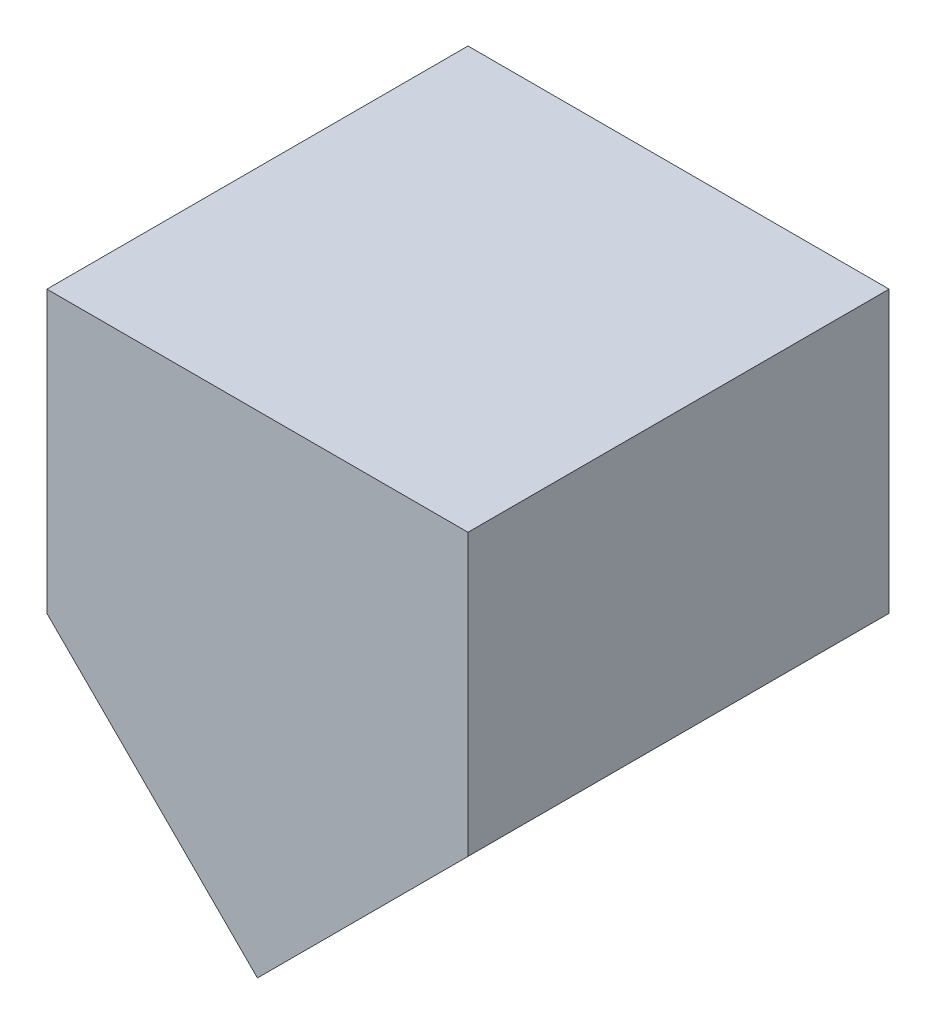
ISO-10303-21;
HEADER;
FILE_DESCRIPTION(('STEP AP214'),'2;1');
FILE_NAME('part.step','',(''),(''),'','','');
FILE_SCHEMA(('AUTOMOTIVE_DESIGN { 1 0 10303 214 1 1 1 1 }'));
ENDSEC;
DATA;
#1=APPLICATION_CONTEXT('core data for automotive mechanical design processes');
#2=APPLICATION_PROTOCOL_DEFINITION('international standard','automotive_design',2000,#1);
#3=PRODUCT_CONTEXT('',#1,'mechanical');
#4=PRODUCT('Part','Part','',(#3));
#5=PRODUCT_RELATED_PRODUCT_CATEGORY('part','',(#4));
#6=PRODUCT_DEFINITION_FORMATION('','',#4);
#7=PRODUCT_DEFINITION_CONTEXT('part definition',#1,'design');
#8=PRODUCT_DEFINITION('design','',#6,#7);
#9=PRODUCT_DEFINITION_SHAPE('','',#8);
#10=(LENGTH_UNIT() NAMED_UNIT(*) SI_UNIT(.MILLI.,.METRE.));
#11=(NAMED_UNIT(*) PLANE_ANGLE_UNIT() SI_UNIT($,.RADIAN.));
#12=(NAMED_UNIT(*) SI_UNIT($,.STERADIAN.) SOLID_ANGLE_UNIT());
#13=UNCERTAINTY_MEASURE_WITH_UNIT(LENGTH_MEASURE(1.E-05),#10,'distance_accuracy_value','');
#14=(GEOMETRIC_REPRESENTATION_CONTEXT(3) GLOBAL_UNCERTAINTY_ASSIGNED_CONTEXT((#13)) GLOBAL_UNIT_ASSIGNED_CONTEXT((#10,
#11,#12)) REPRESENTATION_CONTEXT('',''));
#15=CARTESIAN_POINT('',(0.,0.,0.));
#16=DIRECTION('',(0.,0.,1.));
#17=DIRECTION('',(1.,0.,0.));
#18=AXIS2_PLACEMENT_3D('',#15,#16,#17);
#19=CARTESIAN_POINT('',(0.,0.,15.));
#20=DIRECTION('',(-0.707106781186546,0.707106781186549,0.));
#21=DIRECTION('',(-0.707106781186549,-0.707106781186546,0.));
#22=AXIS2_PLACEMENT_3D('',#19,#20,#21);
#23=PLANE('',#22);
#24=DIRECTION('',(0.707106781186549,0.707106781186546,0.));
#25=VECTOR('',#24,1.);
#26=CARTESIAN_POINT('',(0.,0.,-15.));
#27=LINE('',#26,#25);
#28=CARTESIAN_POINT('',(0.,0.,-15.));
#29=VERTEX_POINT('',#28);
#30=CARTESIAN_POINT('',(15.,14.9999999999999,-15.));
#31=VERTEX_POINT('',#30);
#32=EDGE_CURVE('E83',#29,#31,#27,.T.);
#33=ORIENTED_EDGE('',*,*,#32,.T.);
#34=DIRECTION('',(0.,0.,-1.));
#35=VECTOR('',#34,1.);
#36=CARTESIAN_POINT('',(15.,14.9999999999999,15.));
#37=LINE('',#36,#35);
#38=CARTESIAN_POINT('',(15.,14.9999999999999,15.));
#39=VERTEX_POINT('',#38);
#40=EDGE_CURVE('E11',#39,#31,#37,.T.);
#41=ORIENTED_EDGE('',*,*,#40,.F.);
#42=DIRECTION('',(0.707106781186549,0.707106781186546,0.));
#43=VECTOR('',#42,1.);
#44=CARTESIAN_POINT('',(0.,0.,15.));
#45=LINE('',#44,#43);
#46=CARTESIAN_POINT('',(0.,0.,15.));
#47=VERTEX_POINT('',#46);
#48=EDGE_CURVE('E104',#47,#39,#45,.T.);
#49=ORIENTED_EDGE('',*,*,#48,.F.);
#50=DIRECTION('',(0.,0.,-1.));
#51=VECTOR('',#50,1.);
#52=CARTESIAN_POINT('',(0.,0.,15.));
#53=LINE('',#52,#51);
#54=EDGE_CURVE('E96',#47,#29,#53,.T.);
#55=ORIENTED_EDGE('',*,*,#54,.T.);
#56=EDGE_LOOP('',(#33,#41,#49,#55));
#57=FACE_BOUND('',#56,.T.);
#58=ADVANCED_FACE('F33',(#57),#23,.F.);
#59=CARTESIAN_POINT('',(15.,14.9999999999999,15.));
#60=DIRECTION('',(-1.,0.,0.));
#61=DIRECTION('',(0.,0.,1.));
#62=AXIS2_PLACEMENT_3D('',#59,#60,#61);
#63=PLANE('',#62);
#64=DIRECTION('',(0.,1.,0.));
#65=VECTOR('',#64,1.);
#66=CARTESIAN_POINT('',(15.,14.9999999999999,-15.));
#67=LINE('',#66,#65);
#68=CARTESIAN_POINT('',(15.,34.9999999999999,-15.));
#69=VERTEX_POINT('',#68);
#70=EDGE_CURVE('E79',#31,#69,#67,.T.);
#71=ORIENTED_EDGE('',*,*,#70,.T.);
#72=DIRECTION('',(0.,0.,-1.));
#73=VECTOR('',#72,1.);
#74=CARTESIAN_POINT('',(15.,34.9999999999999,15.));
#75=LINE('',#74,#73);
#76=CARTESIAN_POINT('',(15.,34.9999999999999,15.));
#77=VERTEX_POINT('',#76);
#78=EDGE_CURVE('E40',#77,#69,#75,.T.);
#79=ORIENTED_EDGE('',*,*,#78,.F.);
#80=DIRECTION('',(0.,1.,0.));
#81=VECTOR('',#80,1.);
#82=CARTESIAN_POINT('',(15.,14.9999999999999,15.));
#83=LINE('',#82,#81);
#84=EDGE_CURVE('E92',#39,#77,#83,.T.);
#85=ORIENTED_EDGE('',*,*,#84,.F.);
#86=ORIENTED_EDGE('',*,*,#40,.T.);
#87=EDGE_LOOP('',(#71,#79,#85,#86));
#88=FACE_BOUND('',#87,.T.);
#89=ADVANCED_FACE('F91',(#88),#63,.F.);
#90=CARTESIAN_POINT('',(-15.,34.9999999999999,15.));
#91=DIRECTION('',(0.,-1.,0.));
#92=DIRECTION('',(0.,0.,-1.));
#93=AXIS2_PLACEMENT_3D('',#90,#91,#92);
#94=PLANE('',#93);
#95=DIRECTION('',(-1.,0.,0.));
#96=VECTOR('',#95,1.);
#97=CARTESIAN_POINT('',(-15.,34.9999999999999,-15.));
#98=LINE('',#97,#96);
#99=CARTESIAN_POINT('',(-15.,34.9999999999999,-15.));
#100=VERTEX_POINT('',#99);
#101=EDGE_CURVE('E85',#69,#100,#98,.T.);
#102=ORIENTED_EDGE('',*,*,#101,.T.);
#103=DIRECTION('',(0.,0.,-1.));
#104=VECTOR('',#103,1.);
#105=CARTESIAN_POINT('',(-15.,34.9999999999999,15.));
#106=LINE('',#105,#104);
#107=CARTESIAN_POINT('',(-15.,34.9999999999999,15.));
#108=VERTEX_POINT('',#107);
#109=EDGE_CURVE('E115',#108,#100,#106,.T.);
#110=ORIENTED_EDGE('',*,*,#109,.F.);
#111=DIRECTION('',(-1.,0.,0.));
#112=VECTOR('',#111,1.);
#113=CARTESIAN_POINT('',(-15.,34.9999999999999,15.));
#114=LINE('',#113,#112);
#115=EDGE_CURVE('E107',#77,#108,#114,.T.);
#116=ORIENTED_EDGE('',*,*,#115,.F.);
#117=ORIENTED_EDGE('',*,*,#78,.T.);
#118=EDGE_LOOP('',(#102,#110,#116,#117));
#119=FACE_BOUND('',#118,.T.);
#120=ADVANCED_FACE('F119',(#119),#94,.F.);
#121=CARTESIAN_POINT('',(-15.,14.9999999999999,15.));
#122=DIRECTION('',(1.,0.,0.));
#123=DIRECTION('',(0.,0.,-1.));
#124=AXIS2_PLACEMENT_3D('',#121,#122,#123);
#125=PLANE('',#124);
#126=DIRECTION('',(0.,-1.,0.));
#127=VECTOR('',#126,1.);
#128=CARTESIAN_POINT('',(-15.,14.9999999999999,-15.));
#129=LINE('',#128,#127);
#130=CARTESIAN_POINT('',(-15.,14.9999999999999,-15.));
#131=VERTEX_POINT('',#130);
#132=EDGE_CURVE('E100',#100,#131,#129,.T.);
#133=ORIENTED_EDGE('',*,*,#132,.T.);
#134=DIRECTION('',(0.,0.,-1.));
#135=VECTOR('',#134,1.);
#136=CARTESIAN_POINT('',(-15.,14.9999999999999,15.));
#137=LINE('',#136,#135);
#138=CARTESIAN_POINT('',(-15.,14.9999999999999,15.));
#139=VERTEX_POINT('',#138);
#140=EDGE_CURVE('E112',#139,#131,#137,.T.);
#141=ORIENTED_EDGE('',*,*,#140,.F.);
#142=DIRECTION('',(0.,-1.,0.));
#143=VECTOR('',#142,1.);
#144=CARTESIAN_POINT('',(-15.,14.9999999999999,15.));
#145=LINE('',#144,#143);
#146=EDGE_CURVE('E52',#108,#139,#145,.T.);
#147=ORIENTED_EDGE('',*,*,#146,.F.);
#148=ORIENTED_EDGE('',*,*,#109,.T.);
#149=EDGE_LOOP('',(#133,#141,#147,#148));
#150=FACE_BOUND('',#149,.T.);
#151=ADVANCED_FACE('F130',(#150),#125,.F.);
#152=CARTESIAN_POINT('',(0.,0.,15.));
#153=DIRECTION('',(0.707106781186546,0.707106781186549,0.));
#154=DIRECTION('',(-0.707106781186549,0.707106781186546,0.));
#155=AXIS2_PLACEMENT_3D('',#152,#153,#154);
#156=PLANE('',#155);
#157=DIRECTION('',(0.707106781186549,-0.707106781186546,0.));
#158=VECTOR('',#157,1.);
#159=CARTESIAN_POINT('',(0.,0.,-15.));
#160=LINE('',#159,#158);
#161=EDGE_CURVE('E102',#131,#29,#160,.T.);
#162=ORIENTED_EDGE('',*,*,#161,.T.);
#163=ORIENTED_EDGE('',*,*,#54,.F.);
#164=DIRECTION('',(0.707106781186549,-0.707106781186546,0.));
#165=VECTOR('',#164,1.);
#166=CARTESIAN_POINT('',(0.,0.,15.));
#167=LINE('',#166,#165);
#168=EDGE_CURVE('E47',#139,#47,#167,.T.);
#169=ORIENTED_EDGE('',*,*,#168,.F.);
#170=ORIENTED_EDGE('',*,*,#140,.T.);
#171=EDGE_LOOP('',(#162,#163,#169,#170));
#172=FACE_BOUND('',#171,.T.);
#173=ADVANCED_FACE('F123',(#172),#156,.F.);
#174=CARTESIAN_POINT('',(0.,0.,15.));
#175=DIRECTION('',(0.,0.,1.));
#176=DIRECTION('',(1.,0.,0.));
#177=AXIS2_PLACEMENT_3D('',#174,#175,#176);
#178=PLANE('',#177);
#179=ORIENTED_EDGE('',*,*,#48,.T.);
#180=ORIENTED_EDGE('',*,*,#84,.T.);
#181=ORIENTED_EDGE('',*,*,#115,.T.);
#182=ORIENTED_EDGE('',*,*,#146,.T.);
#183=ORIENTED_EDGE('',*,*,#168,.T.);
#184=EDGE_LOOP('',(#179,#180,#181,#182,#183));
#185=FACE_BOUND('',#184,.T.);
#186=ADVANCED_FACE('F121',(#185),#178,.T.);
#187=CARTESIAN_POINT('',(0.,0.,-15.));
#188=DIRECTION('',(0.,0.,1.));
#189=DIRECTION('',(1.,0.,0.));
#190=AXIS2_PLACEMENT_3D('',#187,#188,#189);
#191=PLANE('',#190);
#192=ORIENTED_EDGE('',*,*,#32,.F.);
#193=ORIENTED_EDGE('',*,*,#161,.F.);
#194=ORIENTED_EDGE('',*,*,#132,.F.);
#195=ORIENTED_EDGE('',*,*,#101,.F.);
#196=ORIENTED_EDGE('',*,*,#70,.F.);
#197=EDGE_LOOP('',(#192,#193,#194,#195,#196));
#198=FACE_BOUND('',#197,.T.);
#199=ADVANCED_FACE('F80',(#198),#191,.F.);
#200=CLOSED_SHELL('',(#58,#89,#120,#151,#173,#186,#199));
#201=MANIFOLD_SOLID_BREP('B2',#200);
#202=ADVANCED_BREP_SHAPE_REPRESENTATION('',(#18,#201),#14);
#203=SHAPE_DEFINITION_REPRESENTATION(#9,#202);
ENDSEC;
END-ISO-10303-21;
